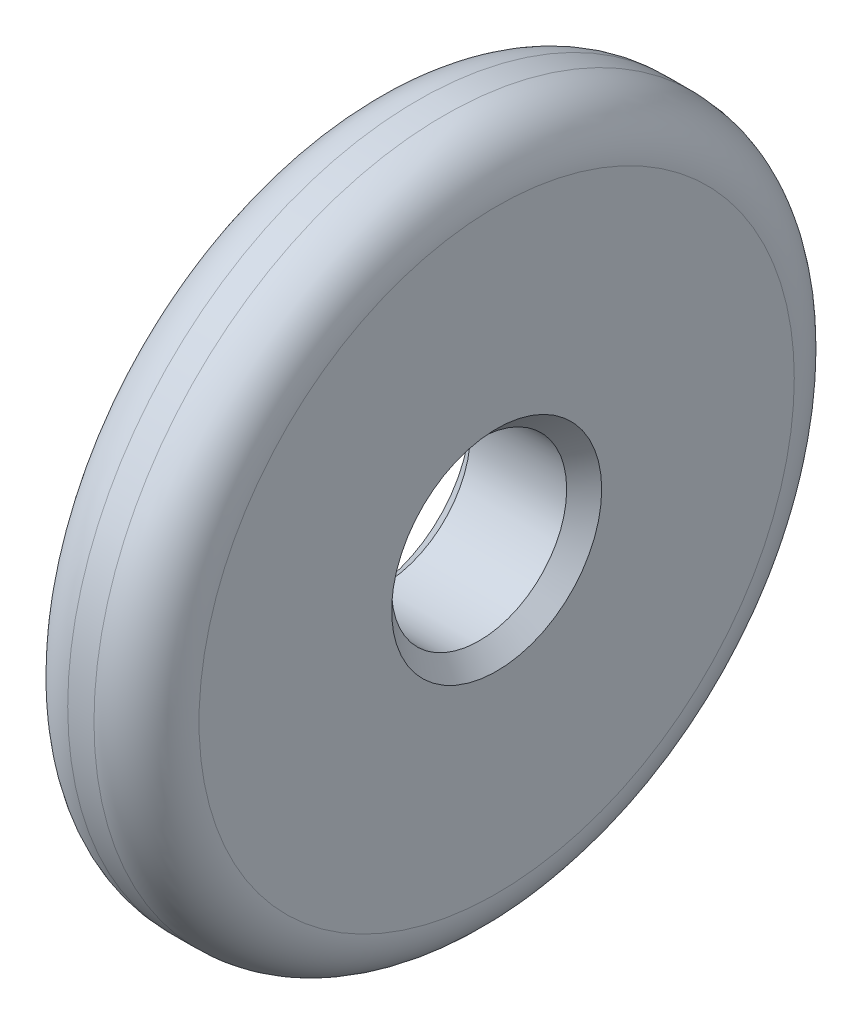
from build123d import *

# Parameters (mm, degrees)
SKETCH1_R           = 20
BOSS_EXTRUDE1_DEPTH = 3.75
SKETCH2_R           = 5
CUT_EXTRUDE1_DEPTH  = 30.261749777
CHAMFER1_SIZE       = 1
FILLET1_R           = 3


with BuildPart() as part:
    # Sketch1 → Boss-Extrude1 (new, symmetric)
    with BuildSketch(Plane(origin=(0, 0, 0), x_dir=(0, 0, -1), z_dir=(1, 0, 0))):
        Circle(SKETCH1_R)
    extrude(amount=BOSS_EXTRUDE1_DEPTH, both=True)

    # Sketch2 → Cut-Extrude1 (cut, through all)
    with BuildSketch(Plane(origin=(3.75, 0, 0), x_dir=(0, 0, -1), z_dir=(1, 0, 0))):
        Circle(SKETCH2_R)
    extrude(amount=-CUT_EXTRUDE1_DEPTH, mode=Mode.SUBTRACT)

    # Chamfer1
    chamfer1_edges = [part.edges().sort_by_distance(p)[0] for p in [
        (-3.75, 0, 5),
        (3.75, 0, 5),
    ]]
    chamfer(chamfer1_edges, length=CHAMFER1_SIZE)

    # Fillet1
    fillet1_edges = [part.edges().sort_by_distance(p)[0] for p in [
        (-3.75, 0, 20),
        (3.75, 0, 20),
    ]]
    fillet(fillet1_edges, radius=FILLET1_R)


solid = part.part
